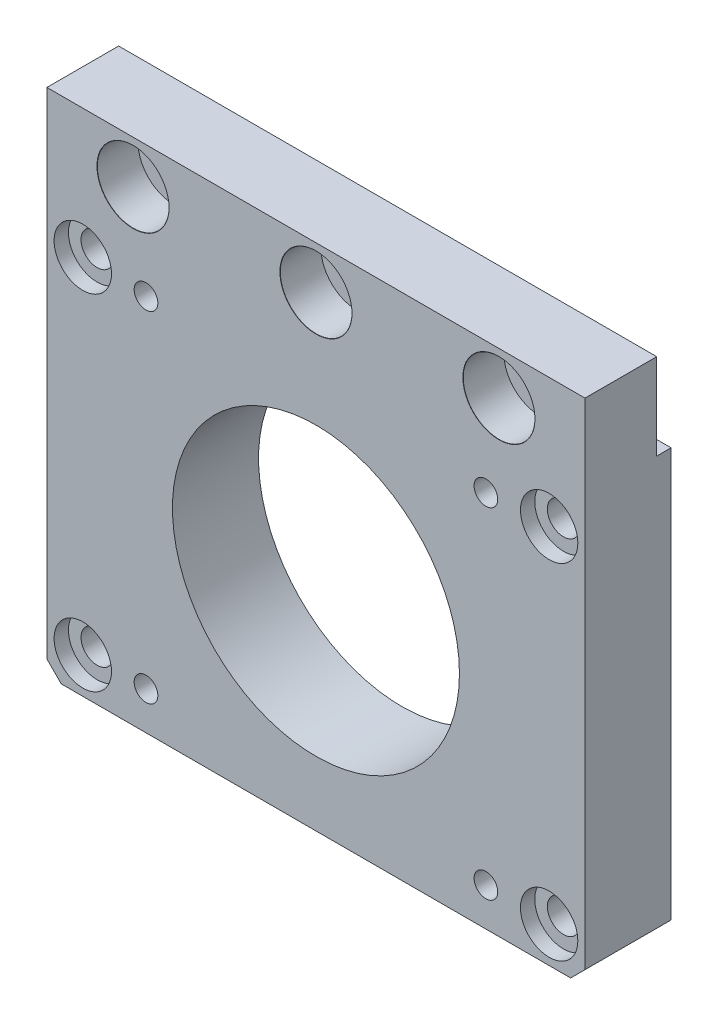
ISO-10303-21;
HEADER;
FILE_DESCRIPTION(('STEP AP214'),'2;1');
FILE_NAME('part.step','',(''),(''),'','','');
FILE_SCHEMA(('AUTOMOTIVE_DESIGN { 1 0 10303 214 1 1 1 1 }'));
ENDSEC;
DATA;
#1=APPLICATION_CONTEXT('core data for automotive mechanical design processes');
#2=APPLICATION_PROTOCOL_DEFINITION('international standard','automotive_design',2000,#1);
#3=PRODUCT_CONTEXT('',#1,'mechanical');
#4=PRODUCT('Part','Part','',(#3));
#5=PRODUCT_RELATED_PRODUCT_CATEGORY('part','',(#4));
#6=PRODUCT_DEFINITION_FORMATION('','',#4);
#7=PRODUCT_DEFINITION_CONTEXT('part definition',#1,'design');
#8=PRODUCT_DEFINITION('design','',#6,#7);
#9=PRODUCT_DEFINITION_SHAPE('','',#8);
#10=(LENGTH_UNIT() NAMED_UNIT(*) SI_UNIT(.MILLI.,.METRE.));
#11=(NAMED_UNIT(*) PLANE_ANGLE_UNIT() SI_UNIT($,.RADIAN.));
#12=(NAMED_UNIT(*) SI_UNIT($,.STERADIAN.) SOLID_ANGLE_UNIT());
#13=UNCERTAINTY_MEASURE_WITH_UNIT(LENGTH_MEASURE(1.E-05),#10,'distance_accuracy_value','');
#14=(GEOMETRIC_REPRESENTATION_CONTEXT(3) GLOBAL_UNCERTAINTY_ASSIGNED_CONTEXT((#13)) GLOBAL_UNIT_ASSIGNED_CONTEXT((#10,
#11,#12)) REPRESENTATION_CONTEXT('',''));
#15=CARTESIAN_POINT('',(0.,0.,0.));
#16=DIRECTION('',(0.,0.,1.));
#17=DIRECTION('',(1.,0.,0.));
#18=AXIS2_PLACEMENT_3D('',#15,#16,#17);
#19=CARTESIAN_POINT('',(-58.,-45.,0.));
#20=DIRECTION('',(0.,0.,-1.));
#21=DIRECTION('',(-1.,0.,0.));
#22=AXIS2_PLACEMENT_3D('',#19,#20,#21);
#23=CYLINDRICAL_SURFACE('',#22,2.25);
#24=CARTESIAN_POINT('',(-58.,-45.,4.625));
#25=DIRECTION('',(0.,0.,-1.));
#26=DIRECTION('',(-1.,0.,0.));
#27=AXIS2_PLACEMENT_3D('',#24,#25,#26);
#28=CIRCLE('',#27,2.25);
#29=CARTESIAN_POINT('',(-60.25,-45.,4.625));
#30=VERTEX_POINT('',#29);
#31=EDGE_CURVE('E317',#30,#30,#28,.T.);
#32=ORIENTED_EDGE('',*,*,#31,.T.);
#33=EDGE_LOOP('',(#32));
#34=FACE_BOUND('',#33,.T.);
#35=CARTESIAN_POINT('',(-58.,-45.,10.));
#36=DIRECTION('',(0.,0.,1.));
#37=DIRECTION('',(1.,0.,0.));
#38=AXIS2_PLACEMENT_3D('',#35,#36,#37);
#39=CIRCLE('',#38,2.25);
#40=CARTESIAN_POINT('',(-55.75,-45.,10.));
#41=VERTEX_POINT('',#40);
#42=EDGE_CURVE('E131',#41,#41,#39,.F.);
#43=ORIENTED_EDGE('',*,*,#42,.F.);
#44=EDGE_LOOP('',(#43));
#45=FACE_BOUND('',#44,.T.);
#46=ADVANCED_FACE('F16',(#34,#45),#23,.F.);
#47=CARTESIAN_POINT('',(7.,-45.,0.));
#48=DIRECTION('',(0.,0.,-1.));
#49=DIRECTION('',(-1.,0.,0.));
#50=AXIS2_PLACEMENT_3D('',#47,#48,#49);
#51=CYLINDRICAL_SURFACE('',#50,2.25);
#52=CARTESIAN_POINT('',(7.,-45.,4.625));
#53=DIRECTION('',(0.,0.,-1.));
#54=DIRECTION('',(-1.,0.,0.));
#55=AXIS2_PLACEMENT_3D('',#52,#53,#54);
#56=CIRCLE('',#55,2.25);
#57=CARTESIAN_POINT('',(4.75,-45.,4.625));
#58=VERTEX_POINT('',#57);
#59=EDGE_CURVE('E302',#58,#58,#56,.T.);
#60=ORIENTED_EDGE('',*,*,#59,.T.);
#61=EDGE_LOOP('',(#60));
#62=FACE_BOUND('',#61,.T.);
#63=CARTESIAN_POINT('',(7.,-45.,10.));
#64=DIRECTION('',(0.,0.,1.));
#65=DIRECTION('',(1.,0.,0.));
#66=AXIS2_PLACEMENT_3D('',#63,#64,#65);
#67=CIRCLE('',#66,2.25);
#68=CARTESIAN_POINT('',(9.25,-45.,10.));
#69=VERTEX_POINT('',#68);
#70=EDGE_CURVE('E126',#69,#69,#67,.F.);
#71=ORIENTED_EDGE('',*,*,#70,.F.);
#72=EDGE_LOOP('',(#71));
#73=FACE_BOUND('',#72,.T.);
#74=ADVANCED_FACE('F403',(#62,#73),#51,.F.);
#75=CARTESIAN_POINT('',(7.,3.,0.));
#76=DIRECTION('',(0.,0.,-1.));
#77=DIRECTION('',(-1.,0.,0.));
#78=AXIS2_PLACEMENT_3D('',#75,#76,#77);
#79=CYLINDRICAL_SURFACE('',#78,2.25);
#80=CARTESIAN_POINT('',(7.,3.,4.625));
#81=DIRECTION('',(0.,0.,-1.));
#82=DIRECTION('',(-1.,0.,0.));
#83=AXIS2_PLACEMENT_3D('',#80,#81,#82);
#84=CIRCLE('',#83,2.25);
#85=CARTESIAN_POINT('',(4.75,3.,4.625));
#86=VERTEX_POINT('',#85);
#87=EDGE_CURVE('E287',#86,#86,#84,.T.);
#88=ORIENTED_EDGE('',*,*,#87,.T.);
#89=EDGE_LOOP('',(#88));
#90=FACE_BOUND('',#89,.T.);
#91=CARTESIAN_POINT('',(7.,3.,10.));
#92=DIRECTION('',(0.,0.,1.));
#93=DIRECTION('',(1.,0.,0.));
#94=AXIS2_PLACEMENT_3D('',#91,#92,#93);
#95=CIRCLE('',#94,2.25);
#96=CARTESIAN_POINT('',(9.25,3.,10.));
#97=VERTEX_POINT('',#96);
#98=EDGE_CURVE('E121',#97,#97,#95,.F.);
#99=ORIENTED_EDGE('',*,*,#98,.F.);
#100=EDGE_LOOP('',(#99));
#101=FACE_BOUND('',#100,.T.);
#102=ADVANCED_FACE('F410',(#90,#101),#79,.F.);
#103=CARTESIAN_POINT('',(-58.,3.,0.));
#104=DIRECTION('',(0.,0.,-1.));
#105=DIRECTION('',(-1.,0.,0.));
#106=AXIS2_PLACEMENT_3D('',#103,#104,#105);
#107=CYLINDRICAL_SURFACE('',#106,2.25);
#108=CARTESIAN_POINT('',(-58.,3.,4.625));
#109=DIRECTION('',(0.,0.,-1.));
#110=DIRECTION('',(-1.,0.,0.));
#111=AXIS2_PLACEMENT_3D('',#108,#109,#110);
#112=CIRCLE('',#111,2.25);
#113=CARTESIAN_POINT('',(-60.25,3.,4.625));
#114=VERTEX_POINT('',#113);
#115=EDGE_CURVE('E272',#114,#114,#112,.T.);
#116=ORIENTED_EDGE('',*,*,#115,.T.);
#117=EDGE_LOOP('',(#116));
#118=FACE_BOUND('',#117,.T.);
#119=CARTESIAN_POINT('',(-58.,3.,10.));
#120=DIRECTION('',(0.,0.,1.));
#121=DIRECTION('',(1.,0.,0.));
#122=AXIS2_PLACEMENT_3D('',#119,#120,#121);
#123=CIRCLE('',#122,2.25);
#124=CARTESIAN_POINT('',(-55.75,3.,10.));
#125=VERTEX_POINT('',#124);
#126=EDGE_CURVE('E116',#125,#125,#123,.F.);
#127=ORIENTED_EDGE('',*,*,#126,.F.);
#128=EDGE_LOOP('',(#127));
#129=FACE_BOUND('',#128,.T.);
#130=ADVANCED_FACE('F453',(#118,#129),#107,.F.);
#131=CARTESIAN_POINT('',(-63.,21.,12.));
#132=DIRECTION('',(1.,0.,0.));
#133=DIRECTION('',(0.,0.,-1.));
#134=AXIS2_PLACEMENT_3D('',#131,#132,#133);
#135=PLANE('',#134);
#136=DIRECTION('',(0.,-1.,0.));
#137=VECTOR('',#136,1.);
#138=CARTESIAN_POINT('',(-63.,21.,0.));
#139=LINE('',#138,#137);
#140=CARTESIAN_POINT('',(-63.,9.,0.));
#141=VERTEX_POINT('',#140);
#142=CARTESIAN_POINT('',(-63.,-48.,0.));
#143=VERTEX_POINT('',#142);
#144=EDGE_CURVE('E166',#141,#143,#139,.T.);
#145=ORIENTED_EDGE('',*,*,#144,.T.);
#146=DIRECTION('',(0.,0.,1.));
#147=VECTOR('',#146,1.);
#148=CARTESIAN_POINT('',(-63.,-48.,12.));
#149=LINE('',#148,#147);
#150=CARTESIAN_POINT('',(-63.,-48.,12.));
#151=VERTEX_POINT('',#150);
#152=EDGE_CURVE('E11',#143,#151,#149,.T.);
#153=ORIENTED_EDGE('',*,*,#152,.T.);
#154=DIRECTION('',(0.,-1.,0.));
#155=VECTOR('',#154,1.);
#156=CARTESIAN_POINT('',(-63.,21.,12.));
#157=LINE('',#156,#155);
#158=CARTESIAN_POINT('',(-63.,21.,12.));
#159=VERTEX_POINT('',#158);
#160=EDGE_CURVE('E105',#159,#151,#157,.T.);
#161=ORIENTED_EDGE('',*,*,#160,.F.);
#162=DIRECTION('',(0.,0.,-1.));
#163=VECTOR('',#162,1.);
#164=CARTESIAN_POINT('',(-63.,21.,12.));
#165=LINE('',#164,#163);
#166=CARTESIAN_POINT('',(-63.,21.,2.));
#167=VERTEX_POINT('',#166);
#168=EDGE_CURVE('E100',#159,#167,#165,.T.);
#169=ORIENTED_EDGE('',*,*,#168,.T.);
#170=DIRECTION('',(0.,-1.,0.));
#171=VECTOR('',#170,1.);
#172=CARTESIAN_POINT('',(-63.,21.,2.));
#173=LINE('',#172,#171);
#174=CARTESIAN_POINT('',(-63.,9.,2.));
#175=VERTEX_POINT('',#174);
#176=EDGE_CURVE('E82',#167,#175,#173,.T.);
#177=ORIENTED_EDGE('',*,*,#176,.T.);
#178=DIRECTION('',(0.,0.,-1.));
#179=VECTOR('',#178,1.);
#180=CARTESIAN_POINT('',(-63.,9.,0.));
#181=LINE('',#180,#179);
#182=EDGE_CURVE('E92',#175,#141,#181,.T.);
#183=ORIENTED_EDGE('',*,*,#182,.T.);
#184=EDGE_LOOP('',(#145,#153,#161,#169,#177,#183));
#185=FACE_BOUND('',#184,.T.);
#186=ADVANCED_FACE('F104',(#185),#135,.F.);
#187=CARTESIAN_POINT('',(-63.,-50.,12.));
#188=DIRECTION('',(0.,1.,0.));
#189=DIRECTION('',(0.,0.,1.));
#190=AXIS2_PLACEMENT_3D('',#187,#188,#189);
#191=PLANE('',#190);
#192=DIRECTION('',(1.,0.,0.));
#193=VECTOR('',#192,1.);
#194=CARTESIAN_POINT('',(-63.,-50.,0.));
#195=LINE('',#194,#193);
#196=CARTESIAN_POINT('',(-61.,-50.,0.));
#197=VERTEX_POINT('',#196);
#198=CARTESIAN_POINT('',(10.,-50.,0.));
#199=VERTEX_POINT('',#198);
#200=EDGE_CURVE('E162',#197,#199,#195,.T.);
#201=ORIENTED_EDGE('',*,*,#200,.T.);
#202=DIRECTION('',(0.,0.,1.));
#203=VECTOR('',#202,1.);
#204=CARTESIAN_POINT('',(10.,-50.,12.));
#205=LINE('',#204,#203);
#206=CARTESIAN_POINT('',(10.,-50.,12.));
#207=VERTEX_POINT('',#206);
#208=EDGE_CURVE('E37',#199,#207,#205,.T.);
#209=ORIENTED_EDGE('',*,*,#208,.T.);
#210=DIRECTION('',(1.,0.,0.));
#211=VECTOR('',#210,1.);
#212=CARTESIAN_POINT('',(-63.,-50.,12.));
#213=LINE('',#212,#211);
#214=CARTESIAN_POINT('',(-61.,-50.,12.));
#215=VERTEX_POINT('',#214);
#216=EDGE_CURVE('E151',#215,#207,#213,.T.);
#217=ORIENTED_EDGE('',*,*,#216,.F.);
#218=DIRECTION('',(0.,0.,-1.));
#219=VECTOR('',#218,1.);
#220=CARTESIAN_POINT('',(-61.,-50.,12.));
#221=LINE('',#220,#219);
#222=EDGE_CURVE('E142',#215,#197,#221,.T.);
#223=ORIENTED_EDGE('',*,*,#222,.T.);
#224=EDGE_LOOP('',(#201,#209,#217,#223));
#225=FACE_BOUND('',#224,.T.);
#226=ADVANCED_FACE('F164',(#225),#191,.F.);
#227=CARTESIAN_POINT('',(12.,21.,12.));
#228=DIRECTION('',(-1.,0.,0.));
#229=DIRECTION('',(0.,-1.,0.));
#230=AXIS2_PLACEMENT_3D('',#227,#228,#229);
#231=PLANE('',#230);
#232=DIRECTION('',(0.,1.,0.));
#233=VECTOR('',#232,1.);
#234=CARTESIAN_POINT('',(12.,21.,12.));
#235=LINE('',#234,#233);
#236=CARTESIAN_POINT('',(12.,-48.,12.));
#237=VERTEX_POINT('',#236);
#238=CARTESIAN_POINT('',(12.,21.,12.));
#239=VERTEX_POINT('',#238);
#240=EDGE_CURVE('E110',#237,#239,#235,.T.);
#241=ORIENTED_EDGE('',*,*,#240,.F.);
#242=DIRECTION('',(0.,0.,-1.));
#243=VECTOR('',#242,1.);
#244=CARTESIAN_POINT('',(12.,-48.,12.));
#245=LINE('',#244,#243);
#246=CARTESIAN_POINT('',(12.,-48.,0.));
#247=VERTEX_POINT('',#246);
#248=EDGE_CURVE('E108',#237,#247,#245,.T.);
#249=ORIENTED_EDGE('',*,*,#248,.T.);
#250=DIRECTION('',(0.,1.,0.));
#251=VECTOR('',#250,1.);
#252=CARTESIAN_POINT('',(12.,21.,0.));
#253=LINE('',#252,#251);
#254=CARTESIAN_POINT('',(12.,9.,0.));
#255=VERTEX_POINT('',#254);
#256=EDGE_CURVE('E113',#247,#255,#253,.T.);
#257=ORIENTED_EDGE('',*,*,#256,.T.);
#258=DIRECTION('',(0.,0.,-1.));
#259=VECTOR('',#258,1.);
#260=CARTESIAN_POINT('',(12.,9.,0.));
#261=LINE('',#260,#259);
#262=CARTESIAN_POINT('',(12.,9.,2.));
#263=VERTEX_POINT('',#262);
#264=EDGE_CURVE('E93',#263,#255,#261,.T.);
#265=ORIENTED_EDGE('',*,*,#264,.F.);
#266=DIRECTION('',(0.,-1.,0.));
#267=VECTOR('',#266,1.);
#268=CARTESIAN_POINT('',(12.,21.,2.));
#269=LINE('',#268,#267);
#270=CARTESIAN_POINT('',(12.,21.,2.));
#271=VERTEX_POINT('',#270);
#272=EDGE_CURVE('E176',#271,#263,#269,.T.);
#273=ORIENTED_EDGE('',*,*,#272,.F.);
#274=DIRECTION('',(0.,0.,-1.));
#275=VECTOR('',#274,1.);
#276=CARTESIAN_POINT('',(12.,21.,12.));
#277=LINE('',#276,#275);
#278=EDGE_CURVE('E102',#239,#271,#277,.T.);
#279=ORIENTED_EDGE('',*,*,#278,.F.);
#280=EDGE_LOOP('',(#241,#249,#257,#265,#273,#279));
#281=FACE_BOUND('',#280,.T.);
#282=ADVANCED_FACE('F155',(#281),#231,.F.);
#283=CARTESIAN_POINT('',(-63.,21.,12.));
#284=DIRECTION('',(0.,-1.,0.));
#285=DIRECTION('',(0.,0.,-1.));
#286=AXIS2_PLACEMENT_3D('',#283,#284,#285);
#287=PLANE('',#286);
#288=ORIENTED_EDGE('',*,*,#278,.T.);
#289=DIRECTION('',(1.,0.,0.));
#290=VECTOR('',#289,1.);
#291=CARTESIAN_POINT('',(-63.,21.,2.));
#292=LINE('',#291,#290);
#293=EDGE_CURVE('E86',#167,#271,#292,.T.);
#294=ORIENTED_EDGE('',*,*,#293,.F.);
#295=ORIENTED_EDGE('',*,*,#168,.F.);
#296=DIRECTION('',(-1.,0.,0.));
#297=VECTOR('',#296,1.);
#298=CARTESIAN_POINT('',(-63.,21.,12.));
#299=LINE('',#298,#297);
#300=EDGE_CURVE('E106',#239,#159,#299,.T.);
#301=ORIENTED_EDGE('',*,*,#300,.F.);
#302=EDGE_LOOP('',(#288,#294,#295,#301));
#303=FACE_BOUND('',#302,.T.);
#304=ADVANCED_FACE('F98',(#303),#287,.F.);
#305=CARTESIAN_POINT('',(0.,0.,12.));
#306=DIRECTION('',(0.,0.,1.));
#307=DIRECTION('',(1.,0.,0.));
#308=AXIS2_PLACEMENT_3D('',#305,#306,#307);
#309=PLANE('',#308);
#310=CARTESIAN_POINT('',(-58.,-45.,12.));
#311=DIRECTION('',(0.,0.,1.));
#312=DIRECTION('',(1.,0.,0.));
#313=AXIS2_PLACEMENT_3D('',#310,#311,#312);
#314=CIRCLE('',#313,4.);
#315=CARTESIAN_POINT('',(-54.,-45.,12.));
#316=VERTEX_POINT('',#315);
#317=EDGE_CURVE('E343',#316,#316,#314,.T.);
#318=ORIENTED_EDGE('',*,*,#317,.F.);
#319=EDGE_LOOP('',(#318));
#320=FACE_BOUND('',#319,.T.);
#321=CARTESIAN_POINT('',(7.,-45.,12.));
#322=DIRECTION('',(0.,0.,1.));
#323=DIRECTION('',(1.,0.,0.));
#324=AXIS2_PLACEMENT_3D('',#321,#322,#323);
#325=CIRCLE('',#324,4.);
#326=CARTESIAN_POINT('',(11.,-45.,12.));
#327=VERTEX_POINT('',#326);
#328=EDGE_CURVE('E134',#327,#327,#325,.T.);
#329=ORIENTED_EDGE('',*,*,#328,.F.);
#330=EDGE_LOOP('',(#329));
#331=FACE_BOUND('',#330,.T.);
#332=CARTESIAN_POINT('',(7.,3.,12.));
#333=DIRECTION('',(0.,0.,1.));
#334=DIRECTION('',(1.,0.,0.));
#335=AXIS2_PLACEMENT_3D('',#332,#333,#334);
#336=CIRCLE('',#335,4.);
#337=CARTESIAN_POINT('',(11.,3.,12.));
#338=VERTEX_POINT('',#337);
#339=EDGE_CURVE('E129',#338,#338,#336,.T.);
#340=ORIENTED_EDGE('',*,*,#339,.F.);
#341=EDGE_LOOP('',(#340));
#342=FACE_BOUND('',#341,.T.);
#343=CARTESIAN_POINT('',(-58.,3.,12.));
#344=DIRECTION('',(0.,0.,1.));
#345=DIRECTION('',(1.,0.,0.));
#346=AXIS2_PLACEMENT_3D('',#343,#344,#345);
#347=CIRCLE('',#346,4.);
#348=CARTESIAN_POINT('',(-54.,3.,12.));
#349=VERTEX_POINT('',#348);
#350=EDGE_CURVE('E124',#349,#349,#347,.T.);
#351=ORIENTED_EDGE('',*,*,#350,.F.);
#352=EDGE_LOOP('',(#351));
#353=FACE_BOUND('',#352,.T.);
#354=CARTESIAN_POINT('',(-49.1880771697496,-44.6880771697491,12.));
#355=DIRECTION('',(0.,0.,-1.));
#356=DIRECTION('',(-1.,0.,0.));
#357=AXIS2_PLACEMENT_3D('',#354,#355,#356);
#358=CIRCLE('',#357,1.65);
#359=CARTESIAN_POINT('',(-50.8380771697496,-44.6880771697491,12.));
#360=VERTEX_POINT('',#359);
#361=EDGE_CURVE('E266',#360,#360,#358,.T.);
#362=ORIENTED_EDGE('',*,*,#361,.T.);
#363=EDGE_LOOP('',(#362));
#364=FACE_BOUND('',#363,.T.);
#365=CARTESIAN_POINT('',(-1.81192283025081,-44.6880771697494,12.));
#366=DIRECTION('',(0.,0.,-1.));
#367=DIRECTION('',(-1.,0.,0.));
#368=AXIS2_PLACEMENT_3D('',#365,#366,#367);
#369=CIRCLE('',#368,1.65);
#370=CARTESIAN_POINT('',(-3.4619228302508,-44.6880771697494,12.));
#371=VERTEX_POINT('',#370);
#372=EDGE_CURVE('E260',#371,#371,#369,.T.);
#373=ORIENTED_EDGE('',*,*,#372,.T.);
#374=EDGE_LOOP('',(#373));
#375=FACE_BOUND('',#374,.T.);
#376=CARTESIAN_POINT('',(-1.81192283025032,2.68807716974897,12.));
#377=DIRECTION('',(0.,0.,-1.));
#378=DIRECTION('',(-1.,0.,0.));
#379=AXIS2_PLACEMENT_3D('',#376,#377,#378);
#380=CIRCLE('',#379,1.65);
#381=CARTESIAN_POINT('',(-3.46192283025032,2.68807716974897,12.));
#382=VERTEX_POINT('',#381);
#383=EDGE_CURVE('E254',#382,#382,#380,.T.);
#384=ORIENTED_EDGE('',*,*,#383,.T.);
#385=EDGE_LOOP('',(#384));
#386=FACE_BOUND('',#385,.T.);
#387=CARTESIAN_POINT('',(-49.1880771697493,2.68807716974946,12.));
#388=DIRECTION('',(0.,0.,-1.));
#389=DIRECTION('',(-1.,0.,0.));
#390=AXIS2_PLACEMENT_3D('',#387,#388,#389);
#391=CIRCLE('',#390,1.65);
#392=CARTESIAN_POINT('',(-50.8380771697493,2.68807716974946,12.));
#393=VERTEX_POINT('',#392);
#394=EDGE_CURVE('E248',#393,#393,#391,.T.);
#395=ORIENTED_EDGE('',*,*,#394,.T.);
#396=EDGE_LOOP('',(#395));
#397=FACE_BOUND('',#396,.T.);
#398=CARTESIAN_POINT('',(0.,15.,12.));
#399=DIRECTION('',(0.,0.,1.));
#400=DIRECTION('',(1.,0.,0.));
#401=AXIS2_PLACEMENT_3D('',#398,#399,#400);
#402=CIRCLE('',#401,5.025);
#403=CARTESIAN_POINT('',(5.02499999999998,15.,12.));
#404=VERTEX_POINT('',#403);
#405=EDGE_CURVE('E242',#404,#404,#402,.T.);
#406=ORIENTED_EDGE('',*,*,#405,.F.);
#407=EDGE_LOOP('',(#406));
#408=FACE_BOUND('',#407,.T.);
#409=CARTESIAN_POINT('',(-25.5,15.,12.));
#410=DIRECTION('',(0.,0.,1.));
#411=DIRECTION('',(1.,0.,0.));
#412=AXIS2_PLACEMENT_3D('',#409,#410,#411);
#413=CIRCLE('',#412,5.025);
#414=CARTESIAN_POINT('',(-20.475,15.,12.));
#415=VERTEX_POINT('',#414);
#416=EDGE_CURVE('E221',#415,#415,#413,.T.);
#417=ORIENTED_EDGE('',*,*,#416,.F.);
#418=EDGE_LOOP('',(#417));
#419=FACE_BOUND('',#418,.T.);
#420=CARTESIAN_POINT('',(-51.,15.,12.));
#421=DIRECTION('',(0.,0.,1.));
#422=DIRECTION('',(1.,0.,0.));
#423=AXIS2_PLACEMENT_3D('',#420,#421,#422);
#424=CIRCLE('',#423,5.025);
#425=CARTESIAN_POINT('',(-45.975,15.,12.));
#426=VERTEX_POINT('',#425);
#427=EDGE_CURVE('E200',#426,#426,#424,.T.);
#428=ORIENTED_EDGE('',*,*,#427,.F.);
#429=EDGE_LOOP('',(#428));
#430=FACE_BOUND('',#429,.T.);
#431=CARTESIAN_POINT('',(-25.5,-21.,12.));
#432=DIRECTION('',(0.,0.,1.));
#433=DIRECTION('',(1.,0.,0.));
#434=AXIS2_PLACEMENT_3D('',#431,#432,#433);
#435=CIRCLE('',#434,20.);
#436=CARTESIAN_POINT('',(-5.5,-21.,12.));
#437=VERTEX_POINT('',#436);
#438=EDGE_CURVE('E180',#437,#437,#435,.T.);
#439=ORIENTED_EDGE('',*,*,#438,.F.);
#440=EDGE_LOOP('',(#439));
#441=FACE_BOUND('',#440,.T.);
#442=ORIENTED_EDGE('',*,*,#216,.T.);
#443=DIRECTION('',(-0.707106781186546,-0.707106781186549,0.));
#444=VECTOR('',#443,1.);
#445=CARTESIAN_POINT('',(30.,-30.,12.));
#446=LINE('',#445,#444);
#447=EDGE_CURVE('E24',#207,#237,#446,.F.);
#448=ORIENTED_EDGE('',*,*,#447,.T.);
#449=ORIENTED_EDGE('',*,*,#240,.T.);
#450=ORIENTED_EDGE('',*,*,#300,.T.);
#451=ORIENTED_EDGE('',*,*,#160,.T.);
#452=DIRECTION('',(-0.707106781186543,0.707106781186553,0.));
#453=VECTOR('',#452,1.);
#454=CARTESIAN_POINT('',(-55.5,-55.5,12.));
#455=LINE('',#454,#453);
#456=EDGE_CURVE('E146',#151,#215,#455,.F.);
#457=ORIENTED_EDGE('',*,*,#456,.T.);
#458=EDGE_LOOP('',(#442,#448,#449,#450,#451,#457));
#459=FACE_BOUND('',#458,.T.);
#460=ADVANCED_FACE('F150',(#320,#331,#342,#353,#364,#375,#386,#397,#408,#419,#430,#441,#459),
#309,.T.);
#461=CARTESIAN_POINT('',(0.,0.,0.));
#462=DIRECTION('',(0.,0.,1.));
#463=DIRECTION('',(1.,0.,0.));
#464=AXIS2_PLACEMENT_3D('',#461,#462,#463);
#465=PLANE('',#464);
#466=CARTESIAN_POINT('',(-58.,-45.,0.));
#467=DIRECTION('',(0.,0.,-1.));
#468=DIRECTION('',(-1.,0.,0.));
#469=AXIS2_PLACEMENT_3D('',#466,#467,#468);
#470=CIRCLE('',#469,4.025);
#471=CARTESIAN_POINT('',(-62.025,-45.,0.));
#472=VERTEX_POINT('',#471);
#473=EDGE_CURVE('E119',#472,#472,#470,.T.);
#474=ORIENTED_EDGE('',*,*,#473,.F.);
#475=EDGE_LOOP('',(#474));
#476=FACE_BOUND('',#475,.T.);
#477=CARTESIAN_POINT('',(7.,-45.,0.));
#478=DIRECTION('',(0.,0.,-1.));
#479=DIRECTION('',(-1.,0.,0.));
#480=AXIS2_PLACEMENT_3D('',#477,#478,#479);
#481=CIRCLE('',#480,4.025);
#482=CARTESIAN_POINT('',(2.975,-45.,0.));
#483=VERTEX_POINT('',#482);
#484=EDGE_CURVE('E314',#483,#483,#481,.T.);
#485=ORIENTED_EDGE('',*,*,#484,.F.);
#486=EDGE_LOOP('',(#485));
#487=FACE_BOUND('',#486,.T.);
#488=CARTESIAN_POINT('',(7.,3.,0.));
#489=DIRECTION('',(0.,0.,-1.));
#490=DIRECTION('',(-1.,0.,0.));
#491=AXIS2_PLACEMENT_3D('',#488,#489,#490);
#492=CIRCLE('',#491,4.025);
#493=CARTESIAN_POINT('',(2.975,3.,0.));
#494=VERTEX_POINT('',#493);
#495=EDGE_CURVE('E299',#494,#494,#492,.T.);
#496=ORIENTED_EDGE('',*,*,#495,.F.);
#497=EDGE_LOOP('',(#496));
#498=FACE_BOUND('',#497,.T.);
#499=CARTESIAN_POINT('',(-58.,3.,0.));
#500=DIRECTION('',(0.,0.,-1.));
#501=DIRECTION('',(-1.,0.,0.));
#502=AXIS2_PLACEMENT_3D('',#499,#500,#501);
#503=CIRCLE('',#502,4.025);
#504=CARTESIAN_POINT('',(-62.025,3.,0.));
#505=VERTEX_POINT('',#504);
#506=EDGE_CURVE('E284',#505,#505,#503,.T.);
#507=ORIENTED_EDGE('',*,*,#506,.F.);
#508=EDGE_LOOP('',(#507));
#509=FACE_BOUND('',#508,.T.);
#510=CARTESIAN_POINT('',(-49.1880771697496,-44.6880771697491,0.));
#511=DIRECTION('',(0.,0.,-1.));
#512=DIRECTION('',(-1.,0.,0.));
#513=AXIS2_PLACEMENT_3D('',#510,#511,#512);
#514=CIRCLE('',#513,1.65);
#515=CARTESIAN_POINT('',(-50.8380771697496,-44.6880771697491,0.));
#516=VERTEX_POINT('',#515);
#517=EDGE_CURVE('E269',#516,#516,#514,.T.);
#518=ORIENTED_EDGE('',*,*,#517,.F.);
#519=EDGE_LOOP('',(#518));
#520=FACE_BOUND('',#519,.T.);
#521=CARTESIAN_POINT('',(-1.81192283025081,-44.6880771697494,0.));
#522=DIRECTION('',(0.,0.,-1.));
#523=DIRECTION('',(-1.,0.,0.));
#524=AXIS2_PLACEMENT_3D('',#521,#522,#523);
#525=CIRCLE('',#524,1.65);
#526=CARTESIAN_POINT('',(-3.4619228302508,-44.6880771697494,0.));
#527=VERTEX_POINT('',#526);
#528=EDGE_CURVE('E263',#527,#527,#525,.T.);
#529=ORIENTED_EDGE('',*,*,#528,.F.);
#530=EDGE_LOOP('',(#529));
#531=FACE_BOUND('',#530,.T.);
#532=CARTESIAN_POINT('',(-1.81192283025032,2.68807716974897,0.));
#533=DIRECTION('',(0.,0.,-1.));
#534=DIRECTION('',(-1.,0.,0.));
#535=AXIS2_PLACEMENT_3D('',#532,#533,#534);
#536=CIRCLE('',#535,1.65);
#537=CARTESIAN_POINT('',(-3.46192283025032,2.68807716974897,0.));
#538=VERTEX_POINT('',#537);
#539=EDGE_CURVE('E257',#538,#538,#536,.T.);
#540=ORIENTED_EDGE('',*,*,#539,.F.);
#541=EDGE_LOOP('',(#540));
#542=FACE_BOUND('',#541,.T.);
#543=CARTESIAN_POINT('',(-49.1880771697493,2.68807716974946,0.));
#544=DIRECTION('',(0.,0.,-1.));
#545=DIRECTION('',(-1.,0.,0.));
#546=AXIS2_PLACEMENT_3D('',#543,#544,#545);
#547=CIRCLE('',#546,1.65);
#548=CARTESIAN_POINT('',(-50.8380771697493,2.68807716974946,0.));
#549=VERTEX_POINT('',#548);
#550=EDGE_CURVE('E251',#549,#549,#547,.T.);
#551=ORIENTED_EDGE('',*,*,#550,.F.);
#552=EDGE_LOOP('',(#551));
#553=FACE_BOUND('',#552,.T.);
#554=CARTESIAN_POINT('',(-25.5,-21.,0.));
#555=DIRECTION('',(0.,0.,1.));
#556=DIRECTION('',(1.,0.,0.));
#557=AXIS2_PLACEMENT_3D('',#554,#555,#556);
#558=CIRCLE('',#557,20.);
#559=CARTESIAN_POINT('',(-5.5,-21.,0.));
#560=VERTEX_POINT('',#559);
#561=EDGE_CURVE('E178',#560,#560,#558,.T.);
#562=ORIENTED_EDGE('',*,*,#561,.T.);
#563=EDGE_LOOP('',(#562));
#564=FACE_BOUND('',#563,.T.);
#565=ORIENTED_EDGE('',*,*,#256,.F.);
#566=DIRECTION('',(0.707106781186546,0.707106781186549,0.));
#567=VECTOR('',#566,1.);
#568=CARTESIAN_POINT('',(12.,-48.,0.));
#569=LINE('',#568,#567);
#570=EDGE_CURVE('E140',#247,#199,#569,.F.);
#571=ORIENTED_EDGE('',*,*,#570,.T.);
#572=ORIENTED_EDGE('',*,*,#200,.F.);
#573=DIRECTION('',(0.707106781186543,-0.707106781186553,0.));
#574=VECTOR('',#573,1.);
#575=CARTESIAN_POINT('',(-61.,-50.,0.));
#576=LINE('',#575,#574);
#577=EDGE_CURVE('E138',#197,#143,#576,.F.);
#578=ORIENTED_EDGE('',*,*,#577,.T.);
#579=ORIENTED_EDGE('',*,*,#144,.F.);
#580=DIRECTION('',(1.,0.,0.));
#581=VECTOR('',#580,1.);
#582=CARTESIAN_POINT('',(-63.,9.,0.));
#583=LINE('',#582,#581);
#584=EDGE_CURVE('E167',#141,#255,#583,.T.);
#585=ORIENTED_EDGE('',*,*,#584,.T.);
#586=EDGE_LOOP('',(#565,#571,#572,#578,#579,#585));
#587=FACE_BOUND('',#586,.T.);
#588=ADVANCED_FACE('F161',(#476,#487,#498,#509,#520,#531,#542,#553,#564,#587),#465,.F.);
#589=CARTESIAN_POINT('',(-63.,9.,0.));
#590=DIRECTION('',(0.,-1.,0.));
#591=DIRECTION('',(1.,0.,0.));
#592=AXIS2_PLACEMENT_3D('',#589,#590,#591);
#593=PLANE('',#592);
#594=ORIENTED_EDGE('',*,*,#264,.T.);
#595=ORIENTED_EDGE('',*,*,#584,.F.);
#596=ORIENTED_EDGE('',*,*,#182,.F.);
#597=DIRECTION('',(1.,0.,0.));
#598=VECTOR('',#597,1.);
#599=CARTESIAN_POINT('',(-63.,9.,2.));
#600=LINE('',#599,#598);
#601=EDGE_CURVE('E88',#175,#263,#600,.T.);
#602=ORIENTED_EDGE('',*,*,#601,.T.);
#603=EDGE_LOOP('',(#594,#595,#596,#602));
#604=FACE_BOUND('',#603,.T.);
#605=ADVANCED_FACE('F397',(#604),#593,.F.);
#606=CARTESIAN_POINT('',(-63.,21.,2.));
#607=DIRECTION('',(0.,0.,1.));
#608=DIRECTION('',(0.,-1.,0.));
#609=AXIS2_PLACEMENT_3D('',#606,#607,#608);
#610=PLANE('',#609);
#611=CARTESIAN_POINT('',(0.,15.,2.));
#612=DIRECTION('',(0.,0.,1.));
#613=DIRECTION('',(1.,0.,0.));
#614=AXIS2_PLACEMENT_3D('',#611,#612,#613);
#615=CIRCLE('',#614,2.775);
#616=CARTESIAN_POINT('',(2.77499999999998,15.,2.));
#617=VERTEX_POINT('',#616);
#618=EDGE_CURVE('E245',#617,#617,#615,.T.);
#619=ORIENTED_EDGE('',*,*,#618,.T.);
#620=EDGE_LOOP('',(#619));
#621=FACE_BOUND('',#620,.T.);
#622=CARTESIAN_POINT('',(-25.5,15.,2.));
#623=DIRECTION('',(0.,0.,1.));
#624=DIRECTION('',(1.,0.,0.));
#625=AXIS2_PLACEMENT_3D('',#622,#623,#624);
#626=CIRCLE('',#625,2.775);
#627=CARTESIAN_POINT('',(-22.725,15.,2.));
#628=VERTEX_POINT('',#627);
#629=EDGE_CURVE('E224',#628,#628,#626,.T.);
#630=ORIENTED_EDGE('',*,*,#629,.T.);
#631=EDGE_LOOP('',(#630));
#632=FACE_BOUND('',#631,.T.);
#633=CARTESIAN_POINT('',(-51.,15.,2.));
#634=DIRECTION('',(0.,0.,1.));
#635=DIRECTION('',(1.,0.,0.));
#636=AXIS2_PLACEMENT_3D('',#633,#634,#635);
#637=CIRCLE('',#636,2.775);
#638=CARTESIAN_POINT('',(-48.225,15.,2.));
#639=VERTEX_POINT('',#638);
#640=EDGE_CURVE('E203',#639,#639,#637,.T.);
#641=ORIENTED_EDGE('',*,*,#640,.T.);
#642=EDGE_LOOP('',(#641));
#643=FACE_BOUND('',#642,.T.);
#644=ORIENTED_EDGE('',*,*,#272,.T.);
#645=ORIENTED_EDGE('',*,*,#601,.F.);
#646=ORIENTED_EDGE('',*,*,#176,.F.);
#647=ORIENTED_EDGE('',*,*,#293,.T.);
#648=EDGE_LOOP('',(#644,#645,#646,#647));
#649=FACE_BOUND('',#648,.T.);
#650=ADVANCED_FACE('F85',(#621,#632,#643,#649),#610,.F.);
#651=CARTESIAN_POINT('',(-25.5,-21.,0.));
#652=DIRECTION('',(0.,0.,1.));
#653=DIRECTION('',(1.,0.,0.));
#654=AXIS2_PLACEMENT_3D('',#651,#652,#653);
#655=CYLINDRICAL_SURFACE('',#654,20.);
#656=ORIENTED_EDGE('',*,*,#561,.F.);
#657=EDGE_LOOP('',(#656));
#658=FACE_BOUND('',#657,.T.);
#659=ORIENTED_EDGE('',*,*,#438,.T.);
#660=EDGE_LOOP('',(#659));
#661=FACE_BOUND('',#660,.T.);
#662=ADVANCED_FACE('F383',(#658,#661),#655,.F.);
#663=CARTESIAN_POINT('',(-51.,15.,2.025));
#664=DIRECTION('',(0.,0.,-1.));
#665=DIRECTION('',(-1.,0.,0.));
#666=AXIS2_PLACEMENT_3D('',#663,#664,#665);
#667=CONICAL_SURFACE('',#666,2.75,0.785398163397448);
#668=ORIENTED_EDGE('',*,*,#640,.F.);
#669=EDGE_LOOP('',(#668));
#670=FACE_BOUND('',#669,.T.);
#671=CARTESIAN_POINT('',(-51.,15.,2.025));
#672=DIRECTION('',(0.,0.,1.));
#673=DIRECTION('',(1.,0.,0.));
#674=AXIS2_PLACEMENT_3D('',#671,#672,#673);
#675=CIRCLE('',#674,2.75);
#676=CARTESIAN_POINT('',(-48.25,15.,2.025));
#677=VERTEX_POINT('',#676);
#678=EDGE_CURVE('E183',#677,#677,#675,.T.);
#679=ORIENTED_EDGE('',*,*,#678,.T.);
#680=EDGE_LOOP('',(#679));
#681=FACE_BOUND('',#680,.T.);
#682=ADVANCED_FACE('F385',(#670,#681),#667,.F.);
#683=CARTESIAN_POINT('',(-51.,15.,12.));
#684=DIRECTION('',(0.,0.,1.));
#685=DIRECTION('',(1.,0.,0.));
#686=AXIS2_PLACEMENT_3D('',#683,#684,#685);
#687=CYLINDRICAL_SURFACE('',#686,2.75);
#688=ORIENTED_EDGE('',*,*,#678,.F.);
#689=EDGE_LOOP('',(#688));
#690=FACE_BOUND('',#689,.T.);
#691=CARTESIAN_POINT('',(-51.,15.,6.275));
#692=DIRECTION('',(0.,0.,1.));
#693=DIRECTION('',(1.,0.,0.));
#694=AXIS2_PLACEMENT_3D('',#691,#692,#693);
#695=CIRCLE('',#694,2.75);
#696=CARTESIAN_POINT('',(-48.25,15.,6.275));
#697=VERTEX_POINT('',#696);
#698=EDGE_CURVE('E188',#697,#697,#695,.T.);
#699=ORIENTED_EDGE('',*,*,#698,.T.);
#700=EDGE_LOOP('',(#699));
#701=FACE_BOUND('',#700,.T.);
#702=ADVANCED_FACE('F394',(#690,#701),#687,.F.);
#703=CARTESIAN_POINT('',(-51.,15.,6.3));
#704=DIRECTION('',(0.,0.,1.));
#705=DIRECTION('',(1.,0.,0.));
#706=AXIS2_PLACEMENT_3D('',#703,#704,#705);
#707=CONICAL_SURFACE('',#706,2.775,0.785398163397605);
#708=ORIENTED_EDGE('',*,*,#698,.F.);
#709=EDGE_LOOP('',(#708));
#710=FACE_BOUND('',#709,.T.);
#711=CARTESIAN_POINT('',(-51.,15.,6.3));
#712=DIRECTION('',(0.,0.,1.));
#713=DIRECTION('',(1.,0.,0.));
#714=AXIS2_PLACEMENT_3D('',#711,#712,#713);
#715=CIRCLE('',#714,2.775);
#716=CARTESIAN_POINT('',(-48.225,15.,6.3));
#717=VERTEX_POINT('',#716);
#718=EDGE_CURVE('E191',#717,#717,#715,.T.);
#719=ORIENTED_EDGE('',*,*,#718,.T.);
#720=EDGE_LOOP('',(#719));
#721=FACE_BOUND('',#720,.T.);
#722=ADVANCED_FACE('F548',(#710,#721),#707,.F.);
#723=CARTESIAN_POINT('',(-48.225,15.,6.3));
#724=DIRECTION('',(0.,0.,-1.));
#725=DIRECTION('',(-1.,0.,0.));
#726=AXIS2_PLACEMENT_3D('',#723,#724,#725);
#727=PLANE('',#726);
#728=ORIENTED_EDGE('',*,*,#718,.F.);
#729=EDGE_LOOP('',(#728));
#730=FACE_BOUND('',#729,.T.);
#731=CARTESIAN_POINT('',(-51.,15.,6.3));
#732=DIRECTION('',(0.,0.,1.));
#733=DIRECTION('',(1.,0.,0.));
#734=AXIS2_PLACEMENT_3D('',#731,#732,#733);
#735=CIRCLE('',#734,5.);
#736=CARTESIAN_POINT('',(-46.,15.,6.3));
#737=VERTEX_POINT('',#736);
#738=EDGE_CURVE('E194',#737,#737,#735,.T.);
#739=ORIENTED_EDGE('',*,*,#738,.T.);
#740=EDGE_LOOP('',(#739));
#741=FACE_BOUND('',#740,.T.);
#742=ADVANCED_FACE('F544',(#730,#741),#727,.F.);
#743=CARTESIAN_POINT('',(-51.,15.,12.));
#744=DIRECTION('',(0.,0.,1.));
#745=DIRECTION('',(1.,0.,0.));
#746=AXIS2_PLACEMENT_3D('',#743,#744,#745);
#747=CYLINDRICAL_SURFACE('',#746,5.);
#748=ORIENTED_EDGE('',*,*,#738,.F.);
#749=EDGE_LOOP('',(#748));
#750=FACE_BOUND('',#749,.T.);
#751=CARTESIAN_POINT('',(-51.,15.,11.975));
#752=DIRECTION('',(0.,0.,1.));
#753=DIRECTION('',(1.,0.,0.));
#754=AXIS2_PLACEMENT_3D('',#751,#752,#753);
#755=CIRCLE('',#754,5.);
#756=CARTESIAN_POINT('',(-46.,15.,11.975));
#757=VERTEX_POINT('',#756);
#758=EDGE_CURVE('E197',#757,#757,#755,.T.);
#759=ORIENTED_EDGE('',*,*,#758,.T.);
#760=EDGE_LOOP('',(#759));
#761=FACE_BOUND('',#760,.T.);
#762=ADVANCED_FACE('F540',(#750,#761),#747,.F.);
#763=CARTESIAN_POINT('',(-51.,15.,12.));
#764=DIRECTION('',(0.,0.,1.));
#765=DIRECTION('',(1.,0.,0.));
#766=AXIS2_PLACEMENT_3D('',#763,#764,#765);
#767=CONICAL_SURFACE('',#766,5.025,0.785398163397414);
#768=ORIENTED_EDGE('',*,*,#758,.F.);
#769=EDGE_LOOP('',(#768));
#770=FACE_BOUND('',#769,.T.);
#771=ORIENTED_EDGE('',*,*,#427,.T.);
#772=EDGE_LOOP('',(#771));
#773=FACE_BOUND('',#772,.T.);
#774=ADVANCED_FACE('F536',(#770,#773),#767,.F.);
#775=CARTESIAN_POINT('',(-25.5,15.,2.025));
#776=DIRECTION('',(0.,0.,-1.));
#777=DIRECTION('',(-1.,0.,0.));
#778=AXIS2_PLACEMENT_3D('',#775,#776,#777);
#779=CONICAL_SURFACE('',#778,2.75,0.785398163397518);
#780=ORIENTED_EDGE('',*,*,#629,.F.);
#781=EDGE_LOOP('',(#780));
#782=FACE_BOUND('',#781,.T.);
#783=CARTESIAN_POINT('',(-25.5,15.,2.025));
#784=DIRECTION('',(0.,0.,1.));
#785=DIRECTION('',(1.,0.,0.));
#786=AXIS2_PLACEMENT_3D('',#783,#784,#785);
#787=CIRCLE('',#786,2.75);
#788=CARTESIAN_POINT('',(-22.75,15.,2.025));
#789=VERTEX_POINT('',#788);
#790=EDGE_CURVE('E206',#789,#789,#787,.T.);
#791=ORIENTED_EDGE('',*,*,#790,.T.);
#792=EDGE_LOOP('',(#791));
#793=FACE_BOUND('',#792,.T.);
#794=ADVANCED_FACE('F532',(#782,#793),#779,.F.);
#795=CARTESIAN_POINT('',(-25.5,15.,12.));
#796=DIRECTION('',(0.,0.,1.));
#797=DIRECTION('',(1.,0.,0.));
#798=AXIS2_PLACEMENT_3D('',#795,#796,#797);
#799=CYLINDRICAL_SURFACE('',#798,2.75);
#800=ORIENTED_EDGE('',*,*,#790,.F.);
#801=EDGE_LOOP('',(#800));
#802=FACE_BOUND('',#801,.T.);
#803=CARTESIAN_POINT('',(-25.5,15.,6.275));
#804=DIRECTION('',(0.,0.,1.));
#805=DIRECTION('',(1.,0.,0.));
#806=AXIS2_PLACEMENT_3D('',#803,#804,#805);
#807=CIRCLE('',#806,2.75);
#808=CARTESIAN_POINT('',(-22.75,15.,6.275));
#809=VERTEX_POINT('',#808);
#810=EDGE_CURVE('E209',#809,#809,#807,.T.);
#811=ORIENTED_EDGE('',*,*,#810,.T.);
#812=EDGE_LOOP('',(#811));
#813=FACE_BOUND('',#812,.T.);
#814=ADVANCED_FACE('F528',(#802,#813),#799,.F.);
#815=CARTESIAN_POINT('',(-25.5,15.,6.3));
#816=DIRECTION('',(0.,0.,1.));
#817=DIRECTION('',(1.,0.,0.));
#818=AXIS2_PLACEMENT_3D('',#815,#816,#817);
#819=CONICAL_SURFACE('',#818,2.775,0.785398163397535);
#820=ORIENTED_EDGE('',*,*,#810,.F.);
#821=EDGE_LOOP('',(#820));
#822=FACE_BOUND('',#821,.T.);
#823=CARTESIAN_POINT('',(-25.5,15.,6.3));
#824=DIRECTION('',(0.,0.,1.));
#825=DIRECTION('',(1.,0.,0.));
#826=AXIS2_PLACEMENT_3D('',#823,#824,#825);
#827=CIRCLE('',#826,2.775);
#828=CARTESIAN_POINT('',(-22.725,15.,6.3));
#829=VERTEX_POINT('',#828);
#830=EDGE_CURVE('E212',#829,#829,#827,.T.);
#831=ORIENTED_EDGE('',*,*,#830,.T.);
#832=EDGE_LOOP('',(#831));
#833=FACE_BOUND('',#832,.T.);
#834=ADVANCED_FACE('F524',(#822,#833),#819,.F.);
#835=CARTESIAN_POINT('',(-22.725,15.,6.3));
#836=DIRECTION('',(0.,0.,-1.));
#837=DIRECTION('',(-1.,0.,0.));
#838=AXIS2_PLACEMENT_3D('',#835,#836,#837);
#839=PLANE('',#838);
#840=ORIENTED_EDGE('',*,*,#830,.F.);
#841=EDGE_LOOP('',(#840));
#842=FACE_BOUND('',#841,.T.);
#843=CARTESIAN_POINT('',(-25.5,15.,6.3));
#844=DIRECTION('',(0.,0.,1.));
#845=DIRECTION('',(1.,0.,0.));
#846=AXIS2_PLACEMENT_3D('',#843,#844,#845);
#847=CIRCLE('',#846,5.);
#848=CARTESIAN_POINT('',(-20.5,15.,6.3));
#849=VERTEX_POINT('',#848);
#850=EDGE_CURVE('E215',#849,#849,#847,.T.);
#851=ORIENTED_EDGE('',*,*,#850,.T.);
#852=EDGE_LOOP('',(#851));
#853=FACE_BOUND('',#852,.T.);
#854=ADVANCED_FACE('F520',(#842,#853),#839,.F.);
#855=CARTESIAN_POINT('',(-25.5,15.,12.));
#856=DIRECTION('',(0.,0.,1.));
#857=DIRECTION('',(1.,0.,0.));
#858=AXIS2_PLACEMENT_3D('',#855,#856,#857);
#859=CYLINDRICAL_SURFACE('',#858,5.);
#860=ORIENTED_EDGE('',*,*,#850,.F.);
#861=EDGE_LOOP('',(#860));
#862=FACE_BOUND('',#861,.T.);
#863=CARTESIAN_POINT('',(-25.5,15.,11.975));
#864=DIRECTION('',(0.,0.,1.));
#865=DIRECTION('',(1.,0.,0.));
#866=AXIS2_PLACEMENT_3D('',#863,#864,#865);
#867=CIRCLE('',#866,5.);
#868=CARTESIAN_POINT('',(-20.5,15.,11.975));
#869=VERTEX_POINT('',#868);
#870=EDGE_CURVE('E218',#869,#869,#867,.T.);
#871=ORIENTED_EDGE('',*,*,#870,.T.);
#872=EDGE_LOOP('',(#871));
#873=FACE_BOUND('',#872,.T.);
#874=ADVANCED_FACE('F516',(#862,#873),#859,.F.);
#875=CARTESIAN_POINT('',(-25.5,15.,12.));
#876=DIRECTION('',(0.,0.,1.));
#877=DIRECTION('',(1.,0.,0.));
#878=AXIS2_PLACEMENT_3D('',#875,#876,#877);
#879=CONICAL_SURFACE('',#878,5.025,0.785398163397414);
#880=ORIENTED_EDGE('',*,*,#870,.F.);
#881=EDGE_LOOP('',(#880));
#882=FACE_BOUND('',#881,.T.);
#883=ORIENTED_EDGE('',*,*,#416,.T.);
#884=EDGE_LOOP('',(#883));
#885=FACE_BOUND('',#884,.T.);
#886=ADVANCED_FACE('F512',(#882,#885),#879,.F.);
#887=CARTESIAN_POINT('',(0.,15.,2.025));
#888=DIRECTION('',(0.,0.,-1.));
#889=DIRECTION('',(-1.,0.,0.));
#890=AXIS2_PLACEMENT_3D('',#887,#888,#889);
#891=CONICAL_SURFACE('',#890,2.75,0.785398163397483);
#892=ORIENTED_EDGE('',*,*,#618,.F.);
#893=EDGE_LOOP('',(#892));
#894=FACE_BOUND('',#893,.T.);
#895=CARTESIAN_POINT('',(0.,15.,2.025));
#896=DIRECTION('',(0.,0.,1.));
#897=DIRECTION('',(1.,0.,0.));
#898=AXIS2_PLACEMENT_3D('',#895,#896,#897);
#899=CIRCLE('',#898,2.75);
#900=CARTESIAN_POINT('',(2.74999999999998,15.,2.025));
#901=VERTEX_POINT('',#900);
#902=EDGE_CURVE('E227',#901,#901,#899,.T.);
#903=ORIENTED_EDGE('',*,*,#902,.T.);
#904=EDGE_LOOP('',(#903));
#905=FACE_BOUND('',#904,.T.);
#906=ADVANCED_FACE('F508',(#894,#905),#891,.F.);
#907=CARTESIAN_POINT('',(0.,15.,12.));
#908=DIRECTION('',(0.,0.,1.));
#909=DIRECTION('',(1.,0.,0.));
#910=AXIS2_PLACEMENT_3D('',#907,#908,#909);
#911=CYLINDRICAL_SURFACE('',#910,2.75);
#912=ORIENTED_EDGE('',*,*,#902,.F.);
#913=EDGE_LOOP('',(#912));
#914=FACE_BOUND('',#913,.T.);
#915=CARTESIAN_POINT('',(0.,15.,6.275));
#916=DIRECTION('',(0.,0.,1.));
#917=DIRECTION('',(1.,0.,0.));
#918=AXIS2_PLACEMENT_3D('',#915,#916,#917);
#919=CIRCLE('',#918,2.75);
#920=CARTESIAN_POINT('',(2.74999999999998,15.,6.275));
#921=VERTEX_POINT('',#920);
#922=EDGE_CURVE('E230',#921,#921,#919,.T.);
#923=ORIENTED_EDGE('',*,*,#922,.T.);
#924=EDGE_LOOP('',(#923));
#925=FACE_BOUND('',#924,.T.);
#926=ADVANCED_FACE('F504',(#914,#925),#911,.F.);
#927=CARTESIAN_POINT('',(0.,15.,6.3));
#928=DIRECTION('',(0.,0.,1.));
#929=DIRECTION('',(1.,0.,0.));
#930=AXIS2_PLACEMENT_3D('',#927,#928,#929);
#931=CONICAL_SURFACE('',#930,2.775,0.785398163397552);
#932=ORIENTED_EDGE('',*,*,#922,.F.);
#933=EDGE_LOOP('',(#932));
#934=FACE_BOUND('',#933,.T.);
#935=CARTESIAN_POINT('',(0.,15.,6.3));
#936=DIRECTION('',(0.,0.,1.));
#937=DIRECTION('',(1.,0.,0.));
#938=AXIS2_PLACEMENT_3D('',#935,#936,#937);
#939=CIRCLE('',#938,2.775);
#940=CARTESIAN_POINT('',(2.77499999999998,15.,6.3));
#941=VERTEX_POINT('',#940);
#942=EDGE_CURVE('E233',#941,#941,#939,.T.);
#943=ORIENTED_EDGE('',*,*,#942,.T.);
#944=EDGE_LOOP('',(#943));
#945=FACE_BOUND('',#944,.T.);
#946=ADVANCED_FACE('F500',(#934,#945),#931,.F.);
#947=CARTESIAN_POINT('',(2.775,15.,6.3));
#948=DIRECTION('',(0.,0.,-1.));
#949=DIRECTION('',(-1.,0.,0.));
#950=AXIS2_PLACEMENT_3D('',#947,#948,#949);
#951=PLANE('',#950);
#952=ORIENTED_EDGE('',*,*,#942,.F.);
#953=EDGE_LOOP('',(#952));
#954=FACE_BOUND('',#953,.T.);
#955=CARTESIAN_POINT('',(0.,15.,6.3));
#956=DIRECTION('',(0.,0.,1.));
#957=DIRECTION('',(1.,0.,0.));
#958=AXIS2_PLACEMENT_3D('',#955,#956,#957);
#959=CIRCLE('',#958,5.);
#960=CARTESIAN_POINT('',(4.99999999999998,15.,6.3));
#961=VERTEX_POINT('',#960);
#962=EDGE_CURVE('E236',#961,#961,#959,.T.);
#963=ORIENTED_EDGE('',*,*,#962,.T.);
#964=EDGE_LOOP('',(#963));
#965=FACE_BOUND('',#964,.T.);
#966=ADVANCED_FACE('F496',(#954,#965),#951,.F.);
#967=CARTESIAN_POINT('',(0.,15.,12.));
#968=DIRECTION('',(0.,0.,1.));
#969=DIRECTION('',(1.,0.,0.));
#970=AXIS2_PLACEMENT_3D('',#967,#968,#969);
#971=CYLINDRICAL_SURFACE('',#970,5.);
#972=ORIENTED_EDGE('',*,*,#962,.F.);
#973=EDGE_LOOP('',(#972));
#974=FACE_BOUND('',#973,.T.);
#975=CARTESIAN_POINT('',(0.,15.,11.975));
#976=DIRECTION('',(0.,0.,1.));
#977=DIRECTION('',(1.,0.,0.));
#978=AXIS2_PLACEMENT_3D('',#975,#976,#977);
#979=CIRCLE('',#978,5.);
#980=CARTESIAN_POINT('',(4.99999999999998,15.,11.975));
#981=VERTEX_POINT('',#980);
#982=EDGE_CURVE('E239',#981,#981,#979,.T.);
#983=ORIENTED_EDGE('',*,*,#982,.T.);
#984=EDGE_LOOP('',(#983));
#985=FACE_BOUND('',#984,.T.);
#986=ADVANCED_FACE('F492',(#974,#985),#971,.F.);
#987=CARTESIAN_POINT('',(0.,15.,12.));
#988=DIRECTION('',(0.,0.,1.));
#989=DIRECTION('',(1.,0.,0.));
#990=AXIS2_PLACEMENT_3D('',#987,#988,#989);
#991=CONICAL_SURFACE('',#990,5.025,0.785398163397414);
#992=ORIENTED_EDGE('',*,*,#982,.F.);
#993=EDGE_LOOP('',(#992));
#994=FACE_BOUND('',#993,.T.);
#995=ORIENTED_EDGE('',*,*,#405,.T.);
#996=EDGE_LOOP('',(#995));
#997=FACE_BOUND('',#996,.T.);
#998=ADVANCED_FACE('F488',(#994,#997),#991,.F.);
#999=CARTESIAN_POINT('',(-49.1880771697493,2.68807716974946,0.));
#1000=DIRECTION('',(0.,0.,-1.));
#1001=DIRECTION('',(-1.,0.,0.));
#1002=AXIS2_PLACEMENT_3D('',#999,#1000,#1001);
#1003=CYLINDRICAL_SURFACE('',#1002,1.65);
#1004=ORIENTED_EDGE('',*,*,#394,.F.);
#1005=EDGE_LOOP('',(#1004));
#1006=FACE_BOUND('',#1005,.T.);
#1007=ORIENTED_EDGE('',*,*,#550,.T.);
#1008=EDGE_LOOP('',(#1007));
#1009=FACE_BOUND('',#1008,.T.);
#1010=ADVANCED_FACE('F484',(#1006,#1009),#1003,.F.);
#1011=CARTESIAN_POINT('',(-1.81192283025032,2.68807716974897,0.));
#1012=DIRECTION('',(0.,0.,-1.));
#1013=DIRECTION('',(-1.,0.,0.));
#1014=AXIS2_PLACEMENT_3D('',#1011,#1012,#1013);
#1015=CYLINDRICAL_SURFACE('',#1014,1.65);
#1016=ORIENTED_EDGE('',*,*,#383,.F.);
#1017=EDGE_LOOP('',(#1016));
#1018=FACE_BOUND('',#1017,.T.);
#1019=ORIENTED_EDGE('',*,*,#539,.T.);
#1020=EDGE_LOOP('',(#1019));
#1021=FACE_BOUND('',#1020,.T.);
#1022=ADVANCED_FACE('F480',(#1018,#1021),#1015,.F.);
#1023=CARTESIAN_POINT('',(-1.81192283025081,-44.6880771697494,0.));
#1024=DIRECTION('',(0.,0.,-1.));
#1025=DIRECTION('',(-1.,0.,0.));
#1026=AXIS2_PLACEMENT_3D('',#1023,#1024,#1025);
#1027=CYLINDRICAL_SURFACE('',#1026,1.65);
#1028=ORIENTED_EDGE('',*,*,#372,.F.);
#1029=EDGE_LOOP('',(#1028));
#1030=FACE_BOUND('',#1029,.T.);
#1031=ORIENTED_EDGE('',*,*,#528,.T.);
#1032=EDGE_LOOP('',(#1031));
#1033=FACE_BOUND('',#1032,.T.);
#1034=ADVANCED_FACE('F476',(#1030,#1033),#1027,.F.);
#1035=CARTESIAN_POINT('',(-49.1880771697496,-44.6880771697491,0.));
#1036=DIRECTION('',(0.,0.,-1.));
#1037=DIRECTION('',(-1.,0.,0.));
#1038=AXIS2_PLACEMENT_3D('',#1035,#1036,#1037);
#1039=CYLINDRICAL_SURFACE('',#1038,1.65);
#1040=ORIENTED_EDGE('',*,*,#361,.F.);
#1041=EDGE_LOOP('',(#1040));
#1042=FACE_BOUND('',#1041,.T.);
#1043=ORIENTED_EDGE('',*,*,#517,.T.);
#1044=EDGE_LOOP('',(#1043));
#1045=FACE_BOUND('',#1044,.T.);
#1046=ADVANCED_FACE('F469',(#1042,#1045),#1039,.F.);
#1047=CARTESIAN_POINT('',(-58.,3.,4.6));
#1048=DIRECTION('',(0.,0.,-1.));
#1049=DIRECTION('',(-1.,0.,0.));
#1050=AXIS2_PLACEMENT_3D('',#1047,#1048,#1049);
#1051=CONICAL_SURFACE('',#1050,2.275,0.785398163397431);
#1052=ORIENTED_EDGE('',*,*,#115,.F.);
#1053=EDGE_LOOP('',(#1052));
#1054=FACE_BOUND('',#1053,.T.);
#1055=CARTESIAN_POINT('',(-58.,3.,4.6));
#1056=DIRECTION('',(0.,0.,-1.));
#1057=DIRECTION('',(-1.,0.,0.));
#1058=AXIS2_PLACEMENT_3D('',#1055,#1056,#1057);
#1059=CIRCLE('',#1058,2.275);
#1060=CARTESIAN_POINT('',(-60.275,3.,4.6));
#1061=VERTEX_POINT('',#1060);
#1062=EDGE_CURVE('E275',#1061,#1061,#1059,.T.);
#1063=ORIENTED_EDGE('',*,*,#1062,.T.);
#1064=EDGE_LOOP('',(#1063));
#1065=FACE_BOUND('',#1064,.T.);
#1066=ADVANCED_FACE('F465',(#1054,#1065),#1051,.F.);
#1067=CARTESIAN_POINT('',(-55.725,3.,4.6));
#1068=DIRECTION('',(0.,0.,1.));
#1069=DIRECTION('',(1.,0.,0.));
#1070=AXIS2_PLACEMENT_3D('',#1067,#1068,#1069);
#1071=PLANE('',#1070);
#1072=ORIENTED_EDGE('',*,*,#1062,.F.);
#1073=EDGE_LOOP('',(#1072));
#1074=FACE_BOUND('',#1073,.T.);
#1075=CARTESIAN_POINT('',(-58.,3.,4.6));
#1076=DIRECTION('',(0.,0.,-1.));
#1077=DIRECTION('',(-1.,0.,0.));
#1078=AXIS2_PLACEMENT_3D('',#1075,#1076,#1077);
#1079=CIRCLE('',#1078,4.);
#1080=CARTESIAN_POINT('',(-62.,3.,4.6));
#1081=VERTEX_POINT('',#1080);
#1082=EDGE_CURVE('E278',#1081,#1081,#1079,.T.);
#1083=ORIENTED_EDGE('',*,*,#1082,.T.);
#1084=EDGE_LOOP('',(#1083));
#1085=FACE_BOUND('',#1084,.T.);
#1086=ADVANCED_FACE('F461',(#1074,#1085),#1071,.F.);
#1087=CARTESIAN_POINT('',(-58.,3.,0.));
#1088=DIRECTION('',(0.,0.,-1.));
#1089=DIRECTION('',(-1.,0.,0.));
#1090=AXIS2_PLACEMENT_3D('',#1087,#1088,#1089);
#1091=CYLINDRICAL_SURFACE('',#1090,4.);
#1092=ORIENTED_EDGE('',*,*,#1082,.F.);
#1093=EDGE_LOOP('',(#1092));
#1094=FACE_BOUND('',#1093,.T.);
#1095=CARTESIAN_POINT('',(-58.,3.,0.0250000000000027));
#1096=DIRECTION('',(0.,0.,-1.));
#1097=DIRECTION('',(-1.,0.,0.));
#1098=AXIS2_PLACEMENT_3D('',#1095,#1096,#1097);
#1099=CIRCLE('',#1098,4.);
#1100=CARTESIAN_POINT('',(-62.,3.,0.0250000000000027));
#1101=VERTEX_POINT('',#1100);
#1102=EDGE_CURVE('E281',#1101,#1101,#1099,.T.);
#1103=ORIENTED_EDGE('',*,*,#1102,.T.);
#1104=EDGE_LOOP('',(#1103));
#1105=FACE_BOUND('',#1104,.T.);
#1106=ADVANCED_FACE('F457',(#1094,#1105),#1091,.F.);
#1107=CARTESIAN_POINT('',(-58.,3.,0.));
#1108=DIRECTION('',(0.,0.,-1.));
#1109=DIRECTION('',(-1.,0.,0.));
#1110=AXIS2_PLACEMENT_3D('',#1107,#1108,#1109);
#1111=CONICAL_SURFACE('',#1110,4.025,0.785398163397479);
#1112=ORIENTED_EDGE('',*,*,#1102,.F.);
#1113=EDGE_LOOP('',(#1112));
#1114=FACE_BOUND('',#1113,.T.);
#1115=ORIENTED_EDGE('',*,*,#506,.T.);
#1116=EDGE_LOOP('',(#1115));
#1117=FACE_BOUND('',#1116,.T.);
#1118=ADVANCED_FACE('F449',(#1114,#1117),#1111,.F.);
#1119=CARTESIAN_POINT('',(7.,3.,4.6));
#1120=DIRECTION('',(0.,0.,-1.));
#1121=DIRECTION('',(-1.,0.,0.));
#1122=AXIS2_PLACEMENT_3D('',#1119,#1120,#1121);
#1123=CONICAL_SURFACE('',#1122,2.275,0.785398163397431);
#1124=ORIENTED_EDGE('',*,*,#87,.F.);
#1125=EDGE_LOOP('',(#1124));
#1126=FACE_BOUND('',#1125,.T.);
#1127=CARTESIAN_POINT('',(7.,3.,4.6));
#1128=DIRECTION('',(0.,0.,-1.));
#1129=DIRECTION('',(-1.,0.,0.));
#1130=AXIS2_PLACEMENT_3D('',#1127,#1128,#1129);
#1131=CIRCLE('',#1130,2.275);
#1132=CARTESIAN_POINT('',(4.725,3.,4.6));
#1133=VERTEX_POINT('',#1132);
#1134=EDGE_CURVE('E290',#1133,#1133,#1131,.T.);
#1135=ORIENTED_EDGE('',*,*,#1134,.T.);
#1136=EDGE_LOOP('',(#1135));
#1137=FACE_BOUND('',#1136,.T.);
#1138=ADVANCED_FACE('F445',(#1126,#1137),#1123,.F.);
#1139=CARTESIAN_POINT('',(9.275,3.,4.6));
#1140=DIRECTION('',(0.,0.,1.));
#1141=DIRECTION('',(1.,0.,0.));
#1142=AXIS2_PLACEMENT_3D('',#1139,#1140,#1141);
#1143=PLANE('',#1142);
#1144=ORIENTED_EDGE('',*,*,#1134,.F.);
#1145=EDGE_LOOP('',(#1144));
#1146=FACE_BOUND('',#1145,.T.);
#1147=CARTESIAN_POINT('',(7.,3.,4.6));
#1148=DIRECTION('',(0.,0.,-1.));
#1149=DIRECTION('',(-1.,0.,0.));
#1150=AXIS2_PLACEMENT_3D('',#1147,#1148,#1149);
#1151=CIRCLE('',#1150,4.);
#1152=CARTESIAN_POINT('',(3.,3.,4.6));
#1153=VERTEX_POINT('',#1152);
#1154=EDGE_CURVE('E293',#1153,#1153,#1151,.T.);
#1155=ORIENTED_EDGE('',*,*,#1154,.T.);
#1156=EDGE_LOOP('',(#1155));
#1157=FACE_BOUND('',#1156,.T.);
#1158=ADVANCED_FACE('F441',(#1146,#1157),#1143,.F.);
#1159=CARTESIAN_POINT('',(7.,3.,0.));
#1160=DIRECTION('',(0.,0.,-1.));
#1161=DIRECTION('',(-1.,0.,0.));
#1162=AXIS2_PLACEMENT_3D('',#1159,#1160,#1161);
#1163=CYLINDRICAL_SURFACE('',#1162,4.);
#1164=ORIENTED_EDGE('',*,*,#1154,.F.);
#1165=EDGE_LOOP('',(#1164));
#1166=FACE_BOUND('',#1165,.T.);
#1167=CARTESIAN_POINT('',(7.,3.,0.0250000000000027));
#1168=DIRECTION('',(0.,0.,-1.));
#1169=DIRECTION('',(-1.,0.,0.));
#1170=AXIS2_PLACEMENT_3D('',#1167,#1168,#1169);
#1171=CIRCLE('',#1170,4.);
#1172=CARTESIAN_POINT('',(3.,3.,0.0250000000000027));
#1173=VERTEX_POINT('',#1172);
#1174=EDGE_CURVE('E296',#1173,#1173,#1171,.T.);
#1175=ORIENTED_EDGE('',*,*,#1174,.T.);
#1176=EDGE_LOOP('',(#1175));
#1177=FACE_BOUND('',#1176,.T.);
#1178=ADVANCED_FACE('F437',(#1166,#1177),#1163,.F.);
#1179=CARTESIAN_POINT('',(7.,3.,0.));
#1180=DIRECTION('',(0.,0.,-1.));
#1181=DIRECTION('',(-1.,0.,0.));
#1182=AXIS2_PLACEMENT_3D('',#1179,#1180,#1181);
#1183=CONICAL_SURFACE('',#1182,4.025,0.785398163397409);
#1184=ORIENTED_EDGE('',*,*,#1174,.F.);
#1185=EDGE_LOOP('',(#1184));
#1186=FACE_BOUND('',#1185,.T.);
#1187=ORIENTED_EDGE('',*,*,#495,.T.);
#1188=EDGE_LOOP('',(#1187));
#1189=FACE_BOUND('',#1188,.T.);
#1190=ADVANCED_FACE('F432',(#1186,#1189),#1183,.F.);
#1191=CARTESIAN_POINT('',(7.,-45.,4.6));
#1192=DIRECTION('',(0.,0.,-1.));
#1193=DIRECTION('',(-1.,0.,0.));
#1194=AXIS2_PLACEMENT_3D('',#1191,#1192,#1193);
#1195=CONICAL_SURFACE('',#1194,2.275,0.785398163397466);
#1196=ORIENTED_EDGE('',*,*,#59,.F.);
#1197=EDGE_LOOP('',(#1196));
#1198=FACE_BOUND('',#1197,.T.);
#1199=CARTESIAN_POINT('',(7.,-45.,4.6));
#1200=DIRECTION('',(0.,0.,-1.));
#1201=DIRECTION('',(-1.,0.,0.));
#1202=AXIS2_PLACEMENT_3D('',#1199,#1200,#1201);
#1203=CIRCLE('',#1202,2.275);
#1204=CARTESIAN_POINT('',(4.725,-45.,4.6));
#1205=VERTEX_POINT('',#1204);
#1206=EDGE_CURVE('E305',#1205,#1205,#1203,.T.);
#1207=ORIENTED_EDGE('',*,*,#1206,.T.);
#1208=EDGE_LOOP('',(#1207));
#1209=FACE_BOUND('',#1208,.T.);
#1210=ADVANCED_FACE('F429',(#1198,#1209),#1195,.F.);
#1211=CARTESIAN_POINT('',(9.275,-45.,4.6));
#1212=DIRECTION('',(0.,0.,1.));
#1213=DIRECTION('',(1.,0.,0.));
#1214=AXIS2_PLACEMENT_3D('',#1211,#1212,#1213);
#1215=PLANE('',#1214);
#1216=ORIENTED_EDGE('',*,*,#1206,.F.);
#1217=EDGE_LOOP('',(#1216));
#1218=FACE_BOUND('',#1217,.T.);
#1219=CARTESIAN_POINT('',(7.,-45.,4.6));
#1220=DIRECTION('',(0.,0.,-1.));
#1221=DIRECTION('',(-1.,0.,0.));
#1222=AXIS2_PLACEMENT_3D('',#1219,#1220,#1221);
#1223=CIRCLE('',#1222,4.);
#1224=CARTESIAN_POINT('',(3.,-45.,4.6));
#1225=VERTEX_POINT('',#1224);
#1226=EDGE_CURVE('E308',#1225,#1225,#1223,.T.);
#1227=ORIENTED_EDGE('',*,*,#1226,.T.);
#1228=EDGE_LOOP('',(#1227));
#1229=FACE_BOUND('',#1228,.T.);
#1230=ADVANCED_FACE('F425',(#1218,#1229),#1215,.F.);
#1231=CARTESIAN_POINT('',(7.,-45.,0.));
#1232=DIRECTION('',(0.,0.,-1.));
#1233=DIRECTION('',(-1.,0.,0.));
#1234=AXIS2_PLACEMENT_3D('',#1231,#1232,#1233);
#1235=CYLINDRICAL_SURFACE('',#1234,4.);
#1236=ORIENTED_EDGE('',*,*,#1226,.F.);
#1237=EDGE_LOOP('',(#1236));
#1238=FACE_BOUND('',#1237,.T.);
#1239=CARTESIAN_POINT('',(7.,-45.,0.0250000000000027));
#1240=DIRECTION('',(0.,0.,-1.));
#1241=DIRECTION('',(-1.,0.,0.));
#1242=AXIS2_PLACEMENT_3D('',#1239,#1240,#1241);
#1243=CIRCLE('',#1242,4.);
#1244=CARTESIAN_POINT('',(3.,-45.,0.0250000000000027));
#1245=VERTEX_POINT('',#1244);
#1246=EDGE_CURVE('E311',#1245,#1245,#1243,.T.);
#1247=ORIENTED_EDGE('',*,*,#1246,.T.);
#1248=EDGE_LOOP('',(#1247));
#1249=FACE_BOUND('',#1248,.T.);
#1250=ADVANCED_FACE('F421',(#1238,#1249),#1235,.F.);
#1251=CARTESIAN_POINT('',(7.,-45.,0.));
#1252=DIRECTION('',(0.,0.,-1.));
#1253=DIRECTION('',(-1.,0.,0.));
#1254=AXIS2_PLACEMENT_3D('',#1251,#1252,#1253);
#1255=CONICAL_SURFACE('',#1254,4.025,0.785398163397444);
#1256=ORIENTED_EDGE('',*,*,#1246,.F.);
#1257=EDGE_LOOP('',(#1256));
#1258=FACE_BOUND('',#1257,.T.);
#1259=ORIENTED_EDGE('',*,*,#484,.T.);
#1260=EDGE_LOOP('',(#1259));
#1261=FACE_BOUND('',#1260,.T.);
#1262=ADVANCED_FACE('F418',(#1258,#1261),#1255,.F.);
#1263=CARTESIAN_POINT('',(-58.,-45.,4.6));
#1264=DIRECTION('',(0.,0.,-1.));
#1265=DIRECTION('',(-1.,0.,0.));
#1266=AXIS2_PLACEMENT_3D('',#1263,#1264,#1265);
#1267=CONICAL_SURFACE('',#1266,2.275,0.785398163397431);
#1268=ORIENTED_EDGE('',*,*,#31,.F.);
#1269=EDGE_LOOP('',(#1268));
#1270=FACE_BOUND('',#1269,.T.);
#1271=CARTESIAN_POINT('',(-58.,-45.,4.6));
#1272=DIRECTION('',(0.,0.,-1.));
#1273=DIRECTION('',(-1.,0.,0.));
#1274=AXIS2_PLACEMENT_3D('',#1271,#1272,#1273);
#1275=CIRCLE('',#1274,2.275);
#1276=CARTESIAN_POINT('',(-60.275,-45.,4.6));
#1277=VERTEX_POINT('',#1276);
#1278=EDGE_CURVE('E320',#1277,#1277,#1275,.T.);
#1279=ORIENTED_EDGE('',*,*,#1278,.T.);
#1280=EDGE_LOOP('',(#1279));
#1281=FACE_BOUND('',#1280,.T.);
#1282=ADVANCED_FACE('F416',(#1270,#1281),#1267,.F.);
#1283=CARTESIAN_POINT('',(-55.725,-45.,4.6));
#1284=DIRECTION('',(0.,0.,1.));
#1285=DIRECTION('',(1.,0.,0.));
#1286=AXIS2_PLACEMENT_3D('',#1283,#1284,#1285);
#1287=PLANE('',#1286);
#1288=ORIENTED_EDGE('',*,*,#1278,.F.);
#1289=EDGE_LOOP('',(#1288));
#1290=FACE_BOUND('',#1289,.T.);
#1291=CARTESIAN_POINT('',(-58.,-45.,4.6));
#1292=DIRECTION('',(0.,0.,-1.));
#1293=DIRECTION('',(-1.,0.,0.));
#1294=AXIS2_PLACEMENT_3D('',#1291,#1292,#1293);
#1295=CIRCLE('',#1294,4.);
#1296=CARTESIAN_POINT('',(-62.,-45.,4.6));
#1297=VERTEX_POINT('',#1296);
#1298=EDGE_CURVE('E323',#1297,#1297,#1295,.T.);
#1299=ORIENTED_EDGE('',*,*,#1298,.T.);
#1300=EDGE_LOOP('',(#1299));
#1301=FACE_BOUND('',#1300,.T.);
#1302=ADVANCED_FACE('F752',(#1290,#1301),#1287,.F.);
#1303=CARTESIAN_POINT('',(-58.,-45.,0.));
#1304=DIRECTION('',(0.,0.,-1.));
#1305=DIRECTION('',(-1.,0.,0.));
#1306=AXIS2_PLACEMENT_3D('',#1303,#1304,#1305);
#1307=CYLINDRICAL_SURFACE('',#1306,4.);
#1308=ORIENTED_EDGE('',*,*,#1298,.F.);
#1309=EDGE_LOOP('',(#1308));
#1310=FACE_BOUND('',#1309,.T.);
#1311=CARTESIAN_POINT('',(-58.,-45.,0.0250000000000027));
#1312=DIRECTION('',(0.,0.,-1.));
#1313=DIRECTION('',(-1.,0.,0.));
#1314=AXIS2_PLACEMENT_3D('',#1311,#1312,#1313);
#1315=CIRCLE('',#1314,4.);
#1316=CARTESIAN_POINT('',(-62.,-45.,0.0250000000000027));
#1317=VERTEX_POINT('',#1316);
#1318=EDGE_CURVE('E326',#1317,#1317,#1315,.T.);
#1319=ORIENTED_EDGE('',*,*,#1318,.T.);
#1320=EDGE_LOOP('',(#1319));
#1321=FACE_BOUND('',#1320,.T.);
#1322=ADVANCED_FACE('F760',(#1310,#1321),#1307,.F.);
#1323=CARTESIAN_POINT('',(-58.,-45.,0.));
#1324=DIRECTION('',(0.,0.,-1.));
#1325=DIRECTION('',(-1.,0.,0.));
#1326=AXIS2_PLACEMENT_3D('',#1323,#1324,#1325);
#1327=CONICAL_SURFACE('',#1326,4.025,0.785398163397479);
#1328=ORIENTED_EDGE('',*,*,#1318,.F.);
#1329=EDGE_LOOP('',(#1328));
#1330=FACE_BOUND('',#1329,.T.);
#1331=ORIENTED_EDGE('',*,*,#473,.T.);
#1332=EDGE_LOOP('',(#1331));
#1333=FACE_BOUND('',#1332,.T.);
#1334=ADVANCED_FACE('F768',(#1330,#1333),#1327,.F.);
#1335=CARTESIAN_POINT('',(-58.,3.,10.));
#1336=DIRECTION('',(0.,0.,1.));
#1337=DIRECTION('',(1.,0.,0.));
#1338=AXIS2_PLACEMENT_3D('',#1335,#1336,#1337);
#1339=PLANE('',#1338);
#1340=CARTESIAN_POINT('',(-58.,3.,10.));
#1341=DIRECTION('',(0.,0.,1.));
#1342=DIRECTION('',(1.,0.,0.));
#1343=AXIS2_PLACEMENT_3D('',#1340,#1341,#1342);
#1344=CIRCLE('',#1343,4.);
#1345=CARTESIAN_POINT('',(-54.,3.,10.));
#1346=VERTEX_POINT('',#1345);
#1347=EDGE_CURVE('E120',#1346,#1346,#1344,.T.);
#1348=ORIENTED_EDGE('',*,*,#1347,.T.);
#1349=EDGE_LOOP('',(#1348));
#1350=FACE_BOUND('',#1349,.T.);
#1351=ORIENTED_EDGE('',*,*,#126,.T.);
#1352=EDGE_LOOP('',(#1351));
#1353=FACE_BOUND('',#1352,.T.);
#1354=ADVANCED_FACE('F777',(#1350,#1353),#1339,.T.);
#1355=CARTESIAN_POINT('',(-58.,3.,10.));
#1356=DIRECTION('',(0.,0.,1.));
#1357=DIRECTION('',(1.,0.,0.));
#1358=AXIS2_PLACEMENT_3D('',#1355,#1356,#1357);
#1359=CYLINDRICAL_SURFACE('',#1358,4.);
#1360=ORIENTED_EDGE('',*,*,#1347,.F.);
#1361=EDGE_LOOP('',(#1360));
#1362=FACE_BOUND('',#1361,.T.);
#1363=ORIENTED_EDGE('',*,*,#350,.T.);
#1364=EDGE_LOOP('',(#1363));
#1365=FACE_BOUND('',#1364,.T.);
#1366=ADVANCED_FACE('F786',(#1362,#1365),#1359,.F.);
#1367=CARTESIAN_POINT('',(7.,3.,10.));
#1368=DIRECTION('',(0.,0.,1.));
#1369=DIRECTION('',(1.,0.,0.));
#1370=AXIS2_PLACEMENT_3D('',#1367,#1368,#1369);
#1371=PLANE('',#1370);
#1372=CARTESIAN_POINT('',(7.,3.,10.));
#1373=DIRECTION('',(0.,0.,1.));
#1374=DIRECTION('',(1.,0.,0.));
#1375=AXIS2_PLACEMENT_3D('',#1372,#1373,#1374);
#1376=CIRCLE('',#1375,4.);
#1377=CARTESIAN_POINT('',(11.,3.,10.));
#1378=VERTEX_POINT('',#1377);
#1379=EDGE_CURVE('E125',#1378,#1378,#1376,.T.);
#1380=ORIENTED_EDGE('',*,*,#1379,.T.);
#1381=EDGE_LOOP('',(#1380));
#1382=FACE_BOUND('',#1381,.T.);
#1383=ORIENTED_EDGE('',*,*,#98,.T.);
#1384=EDGE_LOOP('',(#1383));
#1385=FACE_BOUND('',#1384,.T.);
#1386=ADVANCED_FACE('F795',(#1382,#1385),#1371,.T.);
#1387=CARTESIAN_POINT('',(7.,3.,10.));
#1388=DIRECTION('',(0.,0.,1.));
#1389=DIRECTION('',(1.,0.,0.));
#1390=AXIS2_PLACEMENT_3D('',#1387,#1388,#1389);
#1391=CYLINDRICAL_SURFACE('',#1390,4.);
#1392=ORIENTED_EDGE('',*,*,#1379,.F.);
#1393=EDGE_LOOP('',(#1392));
#1394=FACE_BOUND('',#1393,.T.);
#1395=ORIENTED_EDGE('',*,*,#339,.T.);
#1396=EDGE_LOOP('',(#1395));
#1397=FACE_BOUND('',#1396,.T.);
#1398=ADVANCED_FACE('F804',(#1394,#1397),#1391,.F.);
#1399=CARTESIAN_POINT('',(7.,-45.,10.));
#1400=DIRECTION('',(0.,0.,1.));
#1401=DIRECTION('',(1.,0.,0.));
#1402=AXIS2_PLACEMENT_3D('',#1399,#1400,#1401);
#1403=PLANE('',#1402);
#1404=CARTESIAN_POINT('',(7.,-45.,10.));
#1405=DIRECTION('',(0.,0.,1.));
#1406=DIRECTION('',(1.,0.,0.));
#1407=AXIS2_PLACEMENT_3D('',#1404,#1405,#1406);
#1408=CIRCLE('',#1407,4.);
#1409=CARTESIAN_POINT('',(11.,-45.,10.));
#1410=VERTEX_POINT('',#1409);
#1411=EDGE_CURVE('E130',#1410,#1410,#1408,.T.);
#1412=ORIENTED_EDGE('',*,*,#1411,.T.);
#1413=EDGE_LOOP('',(#1412));
#1414=FACE_BOUND('',#1413,.T.);
#1415=ORIENTED_EDGE('',*,*,#70,.T.);
#1416=EDGE_LOOP('',(#1415));
#1417=FACE_BOUND('',#1416,.T.);
#1418=ADVANCED_FACE('F813',(#1414,#1417),#1403,.T.);
#1419=CARTESIAN_POINT('',(7.,-45.,10.));
#1420=DIRECTION('',(0.,0.,1.));
#1421=DIRECTION('',(1.,0.,0.));
#1422=AXIS2_PLACEMENT_3D('',#1419,#1420,#1421);
#1423=CYLINDRICAL_SURFACE('',#1422,4.);
#1424=ORIENTED_EDGE('',*,*,#1411,.F.);
#1425=EDGE_LOOP('',(#1424));
#1426=FACE_BOUND('',#1425,.T.);
#1427=ORIENTED_EDGE('',*,*,#328,.T.);
#1428=EDGE_LOOP('',(#1427));
#1429=FACE_BOUND('',#1428,.T.);
#1430=ADVANCED_FACE('F822',(#1426,#1429),#1423,.F.);
#1431=CARTESIAN_POINT('',(-58.,-45.,10.));
#1432=DIRECTION('',(0.,0.,1.));
#1433=DIRECTION('',(1.,0.,0.));
#1434=AXIS2_PLACEMENT_3D('',#1431,#1432,#1433);
#1435=PLANE('',#1434);
#1436=CARTESIAN_POINT('',(-58.,-45.,10.));
#1437=DIRECTION('',(0.,0.,1.));
#1438=DIRECTION('',(1.,0.,0.));
#1439=AXIS2_PLACEMENT_3D('',#1436,#1437,#1438);
#1440=CIRCLE('',#1439,4.);
#1441=CARTESIAN_POINT('',(-54.,-45.,10.));
#1442=VERTEX_POINT('',#1441);
#1443=EDGE_CURVE('E135',#1442,#1442,#1440,.T.);
#1444=ORIENTED_EDGE('',*,*,#1443,.T.);
#1445=EDGE_LOOP('',(#1444));
#1446=FACE_BOUND('',#1445,.T.);
#1447=ORIENTED_EDGE('',*,*,#42,.T.);
#1448=EDGE_LOOP('',(#1447));
#1449=FACE_BOUND('',#1448,.T.);
#1450=ADVANCED_FACE('F349',(#1446,#1449),#1435,.T.);
#1451=CARTESIAN_POINT('',(-58.,-45.,10.));
#1452=DIRECTION('',(0.,0.,1.));
#1453=DIRECTION('',(1.,0.,0.));
#1454=AXIS2_PLACEMENT_3D('',#1451,#1452,#1453);
#1455=CYLINDRICAL_SURFACE('',#1454,4.);
#1456=ORIENTED_EDGE('',*,*,#1443,.F.);
#1457=EDGE_LOOP('',(#1456));
#1458=FACE_BOUND('',#1457,.T.);
#1459=ORIENTED_EDGE('',*,*,#317,.T.);
#1460=EDGE_LOOP('',(#1459));
#1461=FACE_BOUND('',#1460,.T.);
#1462=ADVANCED_FACE('F352',(#1458,#1461),#1455,.F.);
#1463=CARTESIAN_POINT('',(12.,-48.,12.));
#1464=DIRECTION('',(-0.707106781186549,0.707106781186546,0.));
#1465=DIRECTION('',(0.,0.,-1.));
#1466=AXIS2_PLACEMENT_3D('',#1463,#1464,#1465);
#1467=PLANE('',#1466);
#1468=ORIENTED_EDGE('',*,*,#447,.F.);
#1469=ORIENTED_EDGE('',*,*,#208,.F.);
#1470=ORIENTED_EDGE('',*,*,#570,.F.);
#1471=ORIENTED_EDGE('',*,*,#248,.F.);
#1472=EDGE_LOOP('',(#1468,#1469,#1470,#1471));
#1473=FACE_BOUND('',#1472,.T.);
#1474=ADVANCED_FACE('F158',(#1473),#1467,.F.);
#1475=CARTESIAN_POINT('',(-61.,-50.,12.));
#1476=DIRECTION('',(0.707106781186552,0.707106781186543,0.));
#1477=DIRECTION('',(0.,0.,-1.));
#1478=AXIS2_PLACEMENT_3D('',#1475,#1476,#1477);
#1479=PLANE('',#1478);
#1480=ORIENTED_EDGE('',*,*,#456,.F.);
#1481=ORIENTED_EDGE('',*,*,#152,.F.);
#1482=ORIENTED_EDGE('',*,*,#577,.F.);
#1483=ORIENTED_EDGE('',*,*,#222,.F.);
#1484=EDGE_LOOP('',(#1480,#1481,#1482,#1483));
#1485=FACE_BOUND('',#1484,.T.);
#1486=ADVANCED_FACE('F18',(#1485),#1479,.F.);
#1487=CLOSED_SHELL('',(#46,#74,#102,#130,#186,#226,#282,#304,#460,#588,#605,#650,#662,#682,#702,
#722,#742,#762,#774,#794,#814,#834,#854,#874,#886,#906,#926,#946,#966,#986,#998,#1010,#1022,
#1034,#1046,#1066,#1086,#1106,#1118,#1138,#1158,#1178,#1190,#1210,#1230,#1250,#1262,#1282,#1302,
#1322,#1334,#1354,#1366,#1386,#1398,#1418,#1430,#1450,#1462,#1474,#1486));
#1488=MANIFOLD_SOLID_BREP('B1',#1487);
#1489=ADVANCED_BREP_SHAPE_REPRESENTATION('',(#18,#1488),#14);
#1490=SHAPE_DEFINITION_REPRESENTATION(#9,#1489);
ENDSEC;
END-ISO-10303-21;
